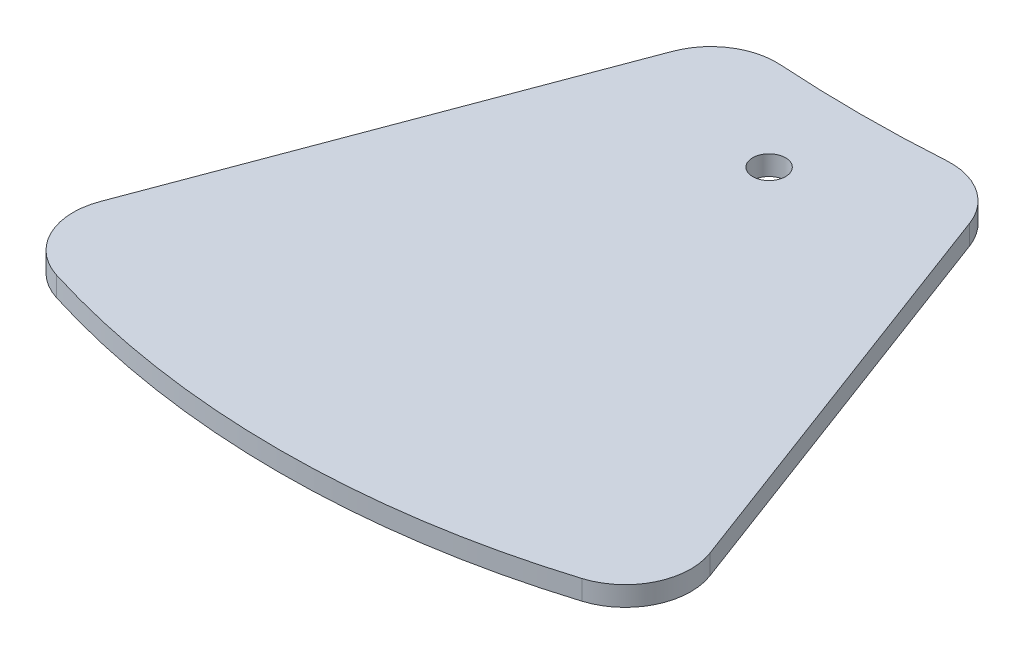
from build123d import *

# Parameters (mm, degrees)
SKETCH1_R           = 2.5
BOSS_EXTRUDE1_DEPTH = 3
FILLET1_R           = 10


with BuildPart() as part:
    # Sketch1 → Boss-Extrude1 (new body)
    with BuildSketch(Plane(origin=(0, 0, 0), x_dir=(1, 0, 0), z_dir=(0, 1, 0))):
        with BuildLine():
            Line((-20, 15), (-50, -65))
            ThreePointArc((-50, -65), (0, -74.606836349), (50, -65))
            Line((50, -65), (20, 15))
            ThreePointArc((20, 15), (0, 13.963939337), (-20, 15))
        make_face()
        with Locations(Location((0, 0, 0), (0, 0, 270))):
            Circle(SKETCH1_R, mode=Mode.SUBTRACT)
    extrude(amount=BOSS_EXTRUDE1_DEPTH)

    # Fillet1
    fillet1_edges = [part.edges().sort_by_distance(p)[0] for p in [
        (20, 1.5, -15),
        (50, 1.5, 65),
        (-50, 1.5, 65),
        (-20, 1.5, -15),
    ]]
    fillet(fillet1_edges, radius=FILLET1_R)


solid = part.part
